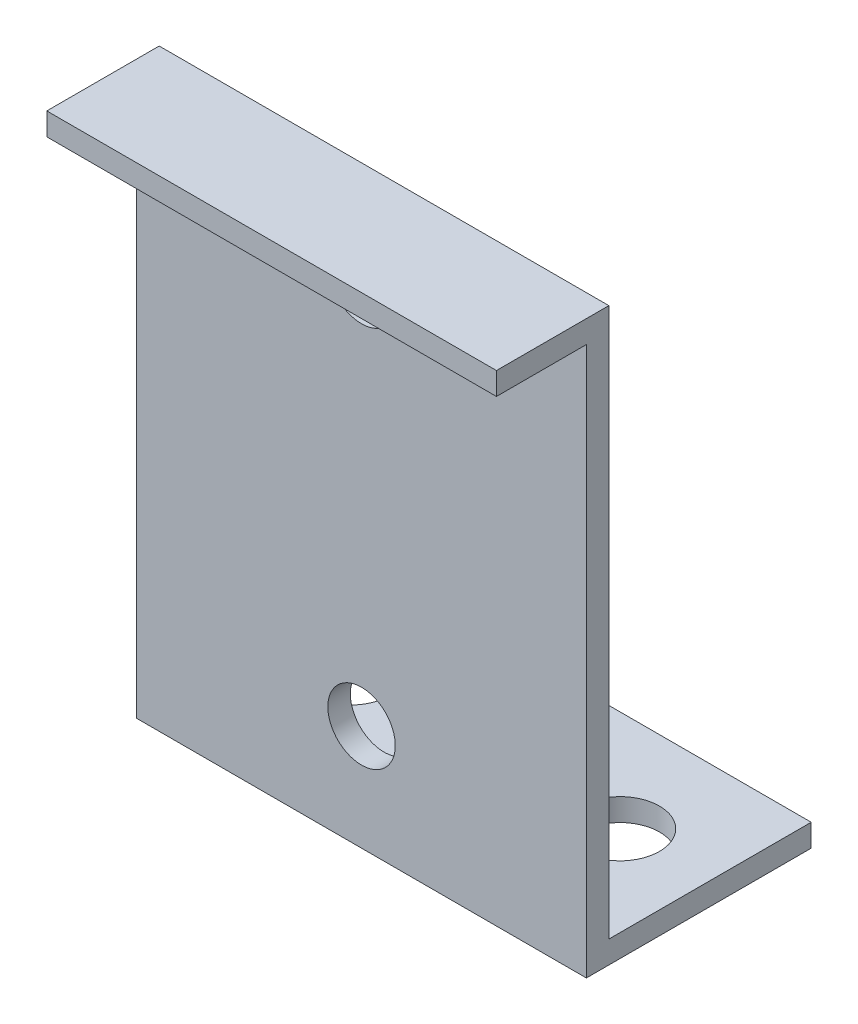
from build123d import *

# Parameters (mm, degrees)
EXTRUDE1_DEPTH = 20
SKETCH2_R      = 1.75
EXTRUDE2_DEPTH = 20
SKETCH3_R      = 1.5
EXTRUDE3_DEPTH = 20


with BuildPart() as part:
    # Sketch1 → Extrude1 (new body)
    with BuildSketch(Plane(origin=(0, 0, 0), x_dir=(0, 0, -1), z_dir=(1, 0, 0))):
        Polygon((10, 0), (0, 0), (0, 24.4), (-4, 24.4), (-4, 25.4), (1, 25.4), (1, 1), (10, 1), align=None)
    extrude(amount=EXTRUDE1_DEPTH)

    # Sketch2 → Extrude2 (cut)
    with BuildSketch(Plane(origin=(0, 1, 0), x_dir=(1, 0, 0), z_dir=(0, 1, 0))):
        with Locations(Location((4, 5.5, 0), (0, 0, 270))):
            Circle(SKETCH2_R)
        with Locations(Location((16, 5.5, 0), (0, 0, 270))):
            Circle(SKETCH2_R)
    extrude(amount=-EXTRUDE2_DEPTH, mode=Mode.SUBTRACT)

    # Sketch3 → Extrude3 (cut)
    with BuildSketch(Plane(origin=(0, 0, -1), x_dir=(-1, 0, 0), z_dir=(0, 0, -1))):
        with Locations((-10, 21.7)):
            Circle(SKETCH3_R)
        with Locations((-10, 4.7)):
            Circle(SKETCH3_R)
    extrude(amount=-EXTRUDE3_DEPTH, mode=Mode.SUBTRACT)


solid = part.part
